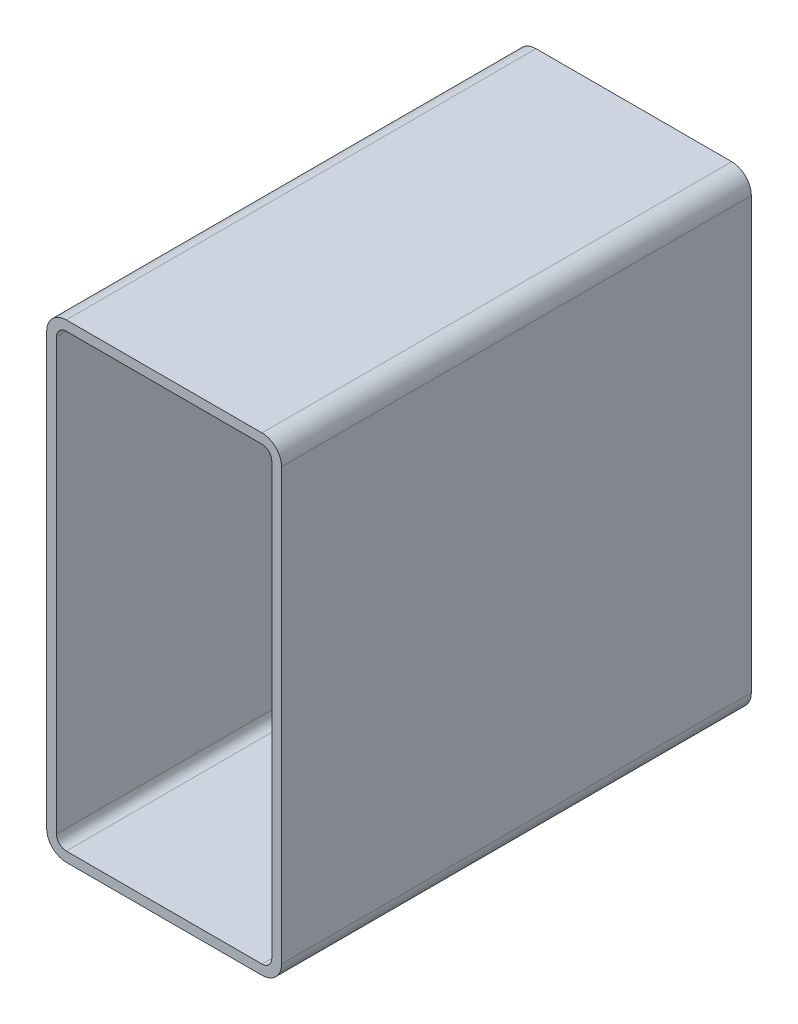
ISO-10303-21;
HEADER;
FILE_DESCRIPTION(('STEP AP214'),'2;1');
FILE_NAME('part.step','',(''),(''),'','','');
FILE_SCHEMA(('AUTOMOTIVE_DESIGN { 1 0 10303 214 1 1 1 1 }'));
ENDSEC;
DATA;
#1=APPLICATION_CONTEXT('core data for automotive mechanical design processes');
#2=APPLICATION_PROTOCOL_DEFINITION('international standard','automotive_design',2000,#1);
#3=PRODUCT_CONTEXT('',#1,'mechanical');
#4=PRODUCT('Part','Part','',(#3));
#5=PRODUCT_RELATED_PRODUCT_CATEGORY('part','',(#4));
#6=PRODUCT_DEFINITION_FORMATION('','',#4);
#7=PRODUCT_DEFINITION_CONTEXT('part definition',#1,'design');
#8=PRODUCT_DEFINITION('design','',#6,#7);
#9=PRODUCT_DEFINITION_SHAPE('','',#8);
#10=(LENGTH_UNIT() NAMED_UNIT(*) SI_UNIT(.MILLI.,.METRE.));
#11=(NAMED_UNIT(*) PLANE_ANGLE_UNIT() SI_UNIT($,.RADIAN.));
#12=(NAMED_UNIT(*) SI_UNIT($,.STERADIAN.) SOLID_ANGLE_UNIT());
#13=UNCERTAINTY_MEASURE_WITH_UNIT(LENGTH_MEASURE(1.E-05),#10,'distance_accuracy_value','');
#14=(GEOMETRIC_REPRESENTATION_CONTEXT(3) GLOBAL_UNCERTAINTY_ASSIGNED_CONTEXT((#13)) GLOBAL_UNIT_ASSIGNED_CONTEXT((#10,
#11,#12)) REPRESENTATION_CONTEXT('',''));
#15=CARTESIAN_POINT('',(0.,0.,0.));
#16=DIRECTION('',(0.,0.,1.));
#17=DIRECTION('',(1.,0.,0.));
#18=AXIS2_PLACEMENT_3D('',#15,#16,#17);
#19=CARTESIAN_POINT('',(12.7473013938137,293.974496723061,304.8));
#20=DIRECTION('',(0.,0.,1.));
#21=DIRECTION('',(1.,0.,0.));
#22=AXIS2_PLACEMENT_3D('',#19,#20,#21);
#23=PLANE('',#22);
#24=CARTESIAN_POINT('',(12.7473013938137,293.974496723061,304.8));
#25=DIRECTION('',(0.,0.,1.));
#26=DIRECTION('',(1.,0.,0.));
#27=AXIS2_PLACEMENT_3D('',#24,#25,#26);
#28=CIRCLE('',#27,12.7);
#29=CARTESIAN_POINT('',(12.7473013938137,306.674496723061,304.8));
#30=VERTEX_POINT('',#29);
#31=CARTESIAN_POINT('',(0.0473013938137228,293.974496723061,304.8));
#32=VERTEX_POINT('',#31);
#33=EDGE_CURVE('E211',#30,#32,#28,.T.);
#34=ORIENTED_EDGE('',*,*,#33,.T.);
#35=DIRECTION('',(0.,-1.,0.));
#36=VECTOR('',#35,1.);
#37=CARTESIAN_POINT('',(0.0473013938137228,14.5744967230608,304.8));
#38=LINE('',#37,#36);
#39=CARTESIAN_POINT('',(0.0473013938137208,14.5744967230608,304.8));
#40=VERTEX_POINT('',#39);
#41=EDGE_CURVE('E214',#32,#40,#38,.T.);
#42=ORIENTED_EDGE('',*,*,#41,.T.);
#43=CARTESIAN_POINT('',(12.7473013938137,14.5744967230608,304.8));
#44=DIRECTION('',(0.,0.,1.));
#45=DIRECTION('',(1.,0.,0.));
#46=AXIS2_PLACEMENT_3D('',#43,#44,#45);
#47=CIRCLE('',#46,12.7);
#48=CARTESIAN_POINT('',(12.7473013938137,1.87449672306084,304.8));
#49=VERTEX_POINT('',#48);
#50=EDGE_CURVE('E217',#40,#49,#47,.T.);
#51=ORIENTED_EDGE('',*,*,#50,.T.);
#52=DIRECTION('',(1.,0.,0.));
#53=VECTOR('',#52,1.);
#54=CARTESIAN_POINT('',(139.747301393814,1.87449672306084,304.8));
#55=LINE('',#54,#53);
#56=CARTESIAN_POINT('',(139.747301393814,1.87449672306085,304.8));
#57=VERTEX_POINT('',#56);
#58=EDGE_CURVE('E219',#49,#57,#55,.T.);
#59=ORIENTED_EDGE('',*,*,#58,.T.);
#60=CARTESIAN_POINT('',(139.747301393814,14.5744967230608,304.8));
#61=DIRECTION('',(0.,0.,1.));
#62=DIRECTION('',(1.,0.,0.));
#63=AXIS2_PLACEMENT_3D('',#60,#61,#62);
#64=CIRCLE('',#63,12.7);
#65=CARTESIAN_POINT('',(152.447301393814,14.5744967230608,304.8));
#66=VERTEX_POINT('',#65);
#67=EDGE_CURVE('E221',#57,#66,#64,.T.);
#68=ORIENTED_EDGE('',*,*,#67,.T.);
#69=DIRECTION('',(0.,1.,0.));
#70=VECTOR('',#69,1.);
#71=CARTESIAN_POINT('',(152.447301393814,293.974496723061,304.8));
#72=LINE('',#71,#70);
#73=CARTESIAN_POINT('',(152.447301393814,293.974496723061,304.8));
#74=VERTEX_POINT('',#73);
#75=EDGE_CURVE('E223',#66,#74,#72,.T.);
#76=ORIENTED_EDGE('',*,*,#75,.T.);
#77=CARTESIAN_POINT('',(139.747301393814,293.974496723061,304.8));
#78=DIRECTION('',(0.,0.,1.));
#79=DIRECTION('',(1.,0.,0.));
#80=AXIS2_PLACEMENT_3D('',#77,#78,#79);
#81=CIRCLE('',#80,12.7);
#82=CARTESIAN_POINT('',(139.747301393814,306.674496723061,304.8));
#83=VERTEX_POINT('',#82);
#84=EDGE_CURVE('E225',#74,#83,#81,.T.);
#85=ORIENTED_EDGE('',*,*,#84,.T.);
#86=DIRECTION('',(-1.,0.,0.));
#87=VECTOR('',#86,1.);
#88=CARTESIAN_POINT('',(12.7473013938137,306.674496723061,304.8));
#89=LINE('',#88,#87);
#90=EDGE_CURVE('E227',#83,#30,#89,.T.);
#91=ORIENTED_EDGE('',*,*,#90,.T.);
#92=EDGE_LOOP('',(#34,#42,#51,#59,#68,#76,#85,#91));
#93=FACE_BOUND('',#92,.T.);
#94=DIRECTION('',(0.,-1.,0.));
#95=VECTOR('',#94,1.);
#96=CARTESIAN_POINT('',(6.39730139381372,14.5744967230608,304.8));
#97=LINE('',#96,#95);
#98=CARTESIAN_POINT('',(6.39730139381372,293.974496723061,304.8));
#99=VERTEX_POINT('',#98);
#100=CARTESIAN_POINT('',(6.39730139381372,14.5744967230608,304.8));
#101=VERTEX_POINT('',#100);
#102=EDGE_CURVE('E154',#99,#101,#97,.T.);
#103=ORIENTED_EDGE('',*,*,#102,.F.);
#104=CARTESIAN_POINT('',(12.7473013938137,293.974496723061,304.8));
#105=DIRECTION('',(0.,0.,1.));
#106=DIRECTION('',(1.,0.,0.));
#107=AXIS2_PLACEMENT_3D('',#104,#105,#106);
#108=CIRCLE('',#107,6.35000000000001);
#109=CARTESIAN_POINT('',(12.7473013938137,300.324496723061,304.8));
#110=VERTEX_POINT('',#109);
#111=EDGE_CURVE('E146',#110,#99,#108,.T.);
#112=ORIENTED_EDGE('',*,*,#111,.F.);
#113=DIRECTION('',(-1.,0.,0.));
#114=VECTOR('',#113,1.);
#115=CARTESIAN_POINT('',(12.7473013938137,300.324496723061,304.8));
#116=LINE('',#115,#114);
#117=CARTESIAN_POINT('',(139.747301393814,300.324496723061,304.8));
#118=VERTEX_POINT('',#117);
#119=EDGE_CURVE('E179',#118,#110,#116,.T.);
#120=ORIENTED_EDGE('',*,*,#119,.F.);
#121=CARTESIAN_POINT('',(139.747301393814,293.974496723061,304.8));
#122=DIRECTION('',(0.,0.,1.));
#123=DIRECTION('',(1.,0.,0.));
#124=AXIS2_PLACEMENT_3D('',#121,#122,#123);
#125=CIRCLE('',#124,6.35000000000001);
#126=CARTESIAN_POINT('',(146.097301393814,293.974496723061,304.8));
#127=VERTEX_POINT('',#126);
#128=EDGE_CURVE('E177',#127,#118,#125,.T.);
#129=ORIENTED_EDGE('',*,*,#128,.F.);
#130=DIRECTION('',(0.,1.,0.));
#131=VECTOR('',#130,1.);
#132=CARTESIAN_POINT('',(146.097301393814,293.974496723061,304.8));
#133=LINE('',#132,#131);
#134=CARTESIAN_POINT('',(146.097301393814,14.5744967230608,304.8));
#135=VERTEX_POINT('',#134);
#136=EDGE_CURVE('E175',#135,#127,#133,.T.);
#137=ORIENTED_EDGE('',*,*,#136,.F.);
#138=CARTESIAN_POINT('',(139.747301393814,14.5744967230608,304.8));
#139=DIRECTION('',(0.,0.,1.));
#140=DIRECTION('',(1.,0.,0.));
#141=AXIS2_PLACEMENT_3D('',#138,#139,#140);
#142=CIRCLE('',#141,6.35);
#143=CARTESIAN_POINT('',(139.747301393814,8.22449672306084,304.8));
#144=VERTEX_POINT('',#143);
#145=EDGE_CURVE('E173',#144,#135,#142,.T.);
#146=ORIENTED_EDGE('',*,*,#145,.F.);
#147=DIRECTION('',(1.,0.,0.));
#148=VECTOR('',#147,1.);
#149=CARTESIAN_POINT('',(139.747301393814,8.22449672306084,304.8));
#150=LINE('',#149,#148);
#151=CARTESIAN_POINT('',(12.7473013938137,8.22449672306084,304.8));
#152=VERTEX_POINT('',#151);
#153=EDGE_CURVE('E169',#152,#144,#150,.T.);
#154=ORIENTED_EDGE('',*,*,#153,.F.);
#155=CARTESIAN_POINT('',(12.7473013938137,14.5744967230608,304.8));
#156=DIRECTION('',(0.,0.,1.));
#157=DIRECTION('',(1.,0.,0.));
#158=AXIS2_PLACEMENT_3D('',#155,#156,#157);
#159=CIRCLE('',#158,6.35);
#160=EDGE_CURVE('E167',#101,#152,#159,.T.);
#161=ORIENTED_EDGE('',*,*,#160,.F.);
#162=EDGE_LOOP('',(#103,#112,#120,#129,#137,#146,#154,#161));
#163=FACE_BOUND('',#162,.T.);
#164=ADVANCED_FACE('F33',(#93,#163),#23,.T.);
#165=CARTESIAN_POINT('',(12.7473013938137,293.974496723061,0.));
#166=DIRECTION('',(0.,0.,1.));
#167=DIRECTION('',(1.,0.,0.));
#168=AXIS2_PLACEMENT_3D('',#165,#166,#167);
#169=PLANE('',#168);
#170=CARTESIAN_POINT('',(12.7473013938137,293.974496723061,0.));
#171=DIRECTION('',(0.,0.,1.));
#172=DIRECTION('',(1.,0.,0.));
#173=AXIS2_PLACEMENT_3D('',#170,#171,#172);
#174=CIRCLE('',#173,12.7);
#175=CARTESIAN_POINT('',(12.7473013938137,306.674496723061,0.));
#176=VERTEX_POINT('',#175);
#177=CARTESIAN_POINT('',(0.0473013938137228,293.974496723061,0.));
#178=VERTEX_POINT('',#177);
#179=EDGE_CURVE('E162',#176,#178,#174,.T.);
#180=ORIENTED_EDGE('',*,*,#179,.F.);
#181=DIRECTION('',(-1.,0.,0.));
#182=VECTOR('',#181,1.);
#183=CARTESIAN_POINT('',(12.7473013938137,306.674496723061,0.));
#184=LINE('',#183,#182);
#185=CARTESIAN_POINT('',(139.747301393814,306.674496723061,0.));
#186=VERTEX_POINT('',#185);
#187=EDGE_CURVE('E215',#186,#176,#184,.T.);
#188=ORIENTED_EDGE('',*,*,#187,.F.);
#189=CARTESIAN_POINT('',(139.747301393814,293.974496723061,0.));
#190=DIRECTION('',(0.,0.,1.));
#191=DIRECTION('',(1.,0.,0.));
#192=AXIS2_PLACEMENT_3D('',#189,#190,#191);
#193=CIRCLE('',#192,12.7);
#194=CARTESIAN_POINT('',(152.447301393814,293.974496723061,0.));
#195=VERTEX_POINT('',#194);
#196=EDGE_CURVE('E242',#195,#186,#193,.T.);
#197=ORIENTED_EDGE('',*,*,#196,.F.);
#198=DIRECTION('',(0.,1.,0.));
#199=VECTOR('',#198,1.);
#200=CARTESIAN_POINT('',(152.447301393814,293.974496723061,0.));
#201=LINE('',#200,#199);
#202=CARTESIAN_POINT('',(152.447301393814,14.5744967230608,0.));
#203=VERTEX_POINT('',#202);
#204=EDGE_CURVE('E240',#203,#195,#201,.T.);
#205=ORIENTED_EDGE('',*,*,#204,.F.);
#206=CARTESIAN_POINT('',(139.747301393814,14.5744967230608,0.));
#207=DIRECTION('',(0.,0.,1.));
#208=DIRECTION('',(1.,0.,0.));
#209=AXIS2_PLACEMENT_3D('',#206,#207,#208);
#210=CIRCLE('',#209,12.7);
#211=CARTESIAN_POINT('',(139.747301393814,1.87449672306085,0.));
#212=VERTEX_POINT('',#211);
#213=EDGE_CURVE('E238',#212,#203,#210,.T.);
#214=ORIENTED_EDGE('',*,*,#213,.F.);
#215=DIRECTION('',(1.,0.,0.));
#216=VECTOR('',#215,1.);
#217=CARTESIAN_POINT('',(139.747301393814,1.87449672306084,0.));
#218=LINE('',#217,#216);
#219=CARTESIAN_POINT('',(12.7473013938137,1.87449672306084,0.));
#220=VERTEX_POINT('',#219);
#221=EDGE_CURVE('E236',#220,#212,#218,.T.);
#222=ORIENTED_EDGE('',*,*,#221,.F.);
#223=CARTESIAN_POINT('',(12.7473013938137,14.5744967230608,0.));
#224=DIRECTION('',(0.,0.,1.));
#225=DIRECTION('',(1.,0.,0.));
#226=AXIS2_PLACEMENT_3D('',#223,#224,#225);
#227=CIRCLE('',#226,12.7);
#228=CARTESIAN_POINT('',(0.0473013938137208,14.5744967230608,0.));
#229=VERTEX_POINT('',#228);
#230=EDGE_CURVE('E234',#229,#220,#227,.T.);
#231=ORIENTED_EDGE('',*,*,#230,.F.);
#232=DIRECTION('',(0.,-1.,0.));
#233=VECTOR('',#232,1.);
#234=CARTESIAN_POINT('',(0.0473013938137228,14.5744967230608,0.));
#235=LINE('',#234,#233);
#236=EDGE_CURVE('E232',#178,#229,#235,.T.);
#237=ORIENTED_EDGE('',*,*,#236,.F.);
#238=EDGE_LOOP('',(#180,#188,#197,#205,#214,#222,#231,#237));
#239=FACE_BOUND('',#238,.T.);
#240=CARTESIAN_POINT('',(12.7473013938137,293.974496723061,0.));
#241=DIRECTION('',(0.,0.,1.));
#242=DIRECTION('',(1.,0.,0.));
#243=AXIS2_PLACEMENT_3D('',#240,#241,#242);
#244=CIRCLE('',#243,6.35000000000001);
#245=CARTESIAN_POINT('',(12.7473013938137,300.324496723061,0.));
#246=VERTEX_POINT('',#245);
#247=CARTESIAN_POINT('',(6.39730139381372,293.974496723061,0.));
#248=VERTEX_POINT('',#247);
#249=EDGE_CURVE('E56',#246,#248,#244,.T.);
#250=ORIENTED_EDGE('',*,*,#249,.T.);
#251=DIRECTION('',(0.,-1.,0.));
#252=VECTOR('',#251,1.);
#253=CARTESIAN_POINT('',(6.39730139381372,14.5744967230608,0.));
#254=LINE('',#253,#252);
#255=CARTESIAN_POINT('',(6.39730139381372,14.5744967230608,0.));
#256=VERTEX_POINT('',#255);
#257=EDGE_CURVE('E161',#248,#256,#254,.T.);
#258=ORIENTED_EDGE('',*,*,#257,.T.);
#259=CARTESIAN_POINT('',(12.7473013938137,14.5744967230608,0.));
#260=DIRECTION('',(0.,0.,1.));
#261=DIRECTION('',(1.,0.,0.));
#262=AXIS2_PLACEMENT_3D('',#259,#260,#261);
#263=CIRCLE('',#262,6.35);
#264=CARTESIAN_POINT('',(12.7473013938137,8.22449672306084,0.));
#265=VERTEX_POINT('',#264);
#266=EDGE_CURVE('E183',#256,#265,#263,.T.);
#267=ORIENTED_EDGE('',*,*,#266,.T.);
#268=DIRECTION('',(1.,0.,0.));
#269=VECTOR('',#268,1.);
#270=CARTESIAN_POINT('',(139.747301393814,8.22449672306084,0.));
#271=LINE('',#270,#269);
#272=CARTESIAN_POINT('',(139.747301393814,8.22449672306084,0.));
#273=VERTEX_POINT('',#272);
#274=EDGE_CURVE('E186',#265,#273,#271,.T.);
#275=ORIENTED_EDGE('',*,*,#274,.T.);
#276=CARTESIAN_POINT('',(139.747301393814,14.5744967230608,0.));
#277=DIRECTION('',(0.,0.,1.));
#278=DIRECTION('',(1.,0.,0.));
#279=AXIS2_PLACEMENT_3D('',#276,#277,#278);
#280=CIRCLE('',#279,6.35);
#281=CARTESIAN_POINT('',(146.097301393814,14.5744967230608,0.));
#282=VERTEX_POINT('',#281);
#283=EDGE_CURVE('E189',#273,#282,#280,.T.);
#284=ORIENTED_EDGE('',*,*,#283,.T.);
#285=DIRECTION('',(0.,1.,0.));
#286=VECTOR('',#285,1.);
#287=CARTESIAN_POINT('',(146.097301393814,293.974496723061,0.));
#288=LINE('',#287,#286);
#289=CARTESIAN_POINT('',(146.097301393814,293.974496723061,0.));
#290=VERTEX_POINT('',#289);
#291=EDGE_CURVE('E192',#282,#290,#288,.T.);
#292=ORIENTED_EDGE('',*,*,#291,.T.);
#293=CARTESIAN_POINT('',(139.747301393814,293.974496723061,0.));
#294=DIRECTION('',(0.,0.,1.));
#295=DIRECTION('',(1.,0.,0.));
#296=AXIS2_PLACEMENT_3D('',#293,#294,#295);
#297=CIRCLE('',#296,6.35000000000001);
#298=CARTESIAN_POINT('',(139.747301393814,300.324496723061,0.));
#299=VERTEX_POINT('',#298);
#300=EDGE_CURVE('E195',#290,#299,#297,.T.);
#301=ORIENTED_EDGE('',*,*,#300,.T.);
#302=DIRECTION('',(-1.,0.,0.));
#303=VECTOR('',#302,1.);
#304=CARTESIAN_POINT('',(12.7473013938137,300.324496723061,0.));
#305=LINE('',#304,#303);
#306=EDGE_CURVE('E155',#299,#246,#305,.T.);
#307=ORIENTED_EDGE('',*,*,#306,.T.);
#308=EDGE_LOOP('',(#250,#258,#267,#275,#284,#292,#301,#307));
#309=FACE_BOUND('',#308,.T.);
#310=ADVANCED_FACE('F272',(#239,#309),#169,.F.);
#311=CARTESIAN_POINT('',(12.7473013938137,293.974496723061,304.8));
#312=DIRECTION('',(0.,0.,-1.));
#313=DIRECTION('',(-1.,0.,0.));
#314=AXIS2_PLACEMENT_3D('',#311,#312,#313);
#315=CYLINDRICAL_SURFACE('',#314,12.7);
#316=ORIENTED_EDGE('',*,*,#179,.T.);
#317=DIRECTION('',(0.,0.,-1.));
#318=VECTOR('',#317,1.);
#319=CARTESIAN_POINT('',(0.0473013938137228,293.974496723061,304.8));
#320=LINE('',#319,#318);
#321=EDGE_CURVE('E11',#32,#178,#320,.T.);
#322=ORIENTED_EDGE('',*,*,#321,.F.);
#323=ORIENTED_EDGE('',*,*,#33,.F.);
#324=DIRECTION('',(0.,0.,-1.));
#325=VECTOR('',#324,1.);
#326=CARTESIAN_POINT('',(12.7473013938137,306.674496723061,304.8));
#327=LINE('',#326,#325);
#328=EDGE_CURVE('E229',#30,#176,#327,.T.);
#329=ORIENTED_EDGE('',*,*,#328,.T.);
#330=EDGE_LOOP('',(#316,#322,#323,#329));
#331=FACE_BOUND('',#330,.T.);
#332=ADVANCED_FACE('F35',(#331),#315,.T.);
#333=CARTESIAN_POINT('',(0.0473013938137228,14.5744967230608,304.8));
#334=DIRECTION('',(1.,0.,0.));
#335=DIRECTION('',(0.,0.,-1.));
#336=AXIS2_PLACEMENT_3D('',#333,#334,#335);
#337=PLANE('',#336);
#338=ORIENTED_EDGE('',*,*,#236,.T.);
#339=DIRECTION('',(0.,0.,-1.));
#340=VECTOR('',#339,1.);
#341=CARTESIAN_POINT('',(0.0473013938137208,14.5744967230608,304.8));
#342=LINE('',#341,#340);
#343=EDGE_CURVE('E41',#40,#229,#342,.T.);
#344=ORIENTED_EDGE('',*,*,#343,.F.);
#345=ORIENTED_EDGE('',*,*,#41,.F.);
#346=ORIENTED_EDGE('',*,*,#321,.T.);
#347=EDGE_LOOP('',(#338,#344,#345,#346));
#348=FACE_BOUND('',#347,.T.);
#349=ADVANCED_FACE('F289',(#348),#337,.F.);
#350=CARTESIAN_POINT('',(12.7473013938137,14.5744967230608,304.8));
#351=DIRECTION('',(0.,0.,-1.));
#352=DIRECTION('',(-1.,0.,0.));
#353=AXIS2_PLACEMENT_3D('',#350,#351,#352);
#354=CYLINDRICAL_SURFACE('',#353,12.7);
#355=ORIENTED_EDGE('',*,*,#230,.T.);
#356=DIRECTION('',(0.,0.,-1.));
#357=VECTOR('',#356,1.);
#358=CARTESIAN_POINT('',(12.7473013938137,1.87449672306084,304.8));
#359=LINE('',#358,#357);
#360=EDGE_CURVE('E259',#49,#220,#359,.T.);
#361=ORIENTED_EDGE('',*,*,#360,.F.);
#362=ORIENTED_EDGE('',*,*,#50,.F.);
#363=ORIENTED_EDGE('',*,*,#343,.T.);
#364=EDGE_LOOP('',(#355,#361,#362,#363));
#365=FACE_BOUND('',#364,.T.);
#366=ADVANCED_FACE('F266',(#365),#354,.T.);
#367=CARTESIAN_POINT('',(139.747301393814,1.87449672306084,304.8));
#368=DIRECTION('',(0.,1.,0.));
#369=DIRECTION('',(0.,0.,1.));
#370=AXIS2_PLACEMENT_3D('',#367,#368,#369);
#371=PLANE('',#370);
#372=ORIENTED_EDGE('',*,*,#221,.T.);
#373=DIRECTION('',(0.,0.,-1.));
#374=VECTOR('',#373,1.);
#375=CARTESIAN_POINT('',(139.747301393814,1.87449672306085,304.8));
#376=LINE('',#375,#374);
#377=EDGE_CURVE('E256',#57,#212,#376,.T.);
#378=ORIENTED_EDGE('',*,*,#377,.F.);
#379=ORIENTED_EDGE('',*,*,#58,.F.);
#380=ORIENTED_EDGE('',*,*,#360,.T.);
#381=EDGE_LOOP('',(#372,#378,#379,#380));
#382=FACE_BOUND('',#381,.T.);
#383=ADVANCED_FACE('F278',(#382),#371,.F.);
#384=CARTESIAN_POINT('',(139.747301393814,14.5744967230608,304.8));
#385=DIRECTION('',(0.,0.,-1.));
#386=DIRECTION('',(-1.,0.,0.));
#387=AXIS2_PLACEMENT_3D('',#384,#385,#386);
#388=CYLINDRICAL_SURFACE('',#387,12.7);
#389=ORIENTED_EDGE('',*,*,#213,.T.);
#390=DIRECTION('',(0.,0.,-1.));
#391=VECTOR('',#390,1.);
#392=CARTESIAN_POINT('',(152.447301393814,14.5744967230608,304.8));
#393=LINE('',#392,#391);
#394=EDGE_CURVE('E253',#66,#203,#393,.T.);
#395=ORIENTED_EDGE('',*,*,#394,.F.);
#396=ORIENTED_EDGE('',*,*,#67,.F.);
#397=ORIENTED_EDGE('',*,*,#377,.T.);
#398=EDGE_LOOP('',(#389,#395,#396,#397));
#399=FACE_BOUND('',#398,.T.);
#400=ADVANCED_FACE('F282',(#399),#388,.T.);
#401=CARTESIAN_POINT('',(152.447301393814,293.974496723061,304.8));
#402=DIRECTION('',(-1.,0.,0.));
#403=DIRECTION('',(0.,0.,1.));
#404=AXIS2_PLACEMENT_3D('',#401,#402,#403);
#405=PLANE('',#404);
#406=ORIENTED_EDGE('',*,*,#204,.T.);
#407=DIRECTION('',(0.,0.,-1.));
#408=VECTOR('',#407,1.);
#409=CARTESIAN_POINT('',(152.447301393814,293.974496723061,304.8));
#410=LINE('',#409,#408);
#411=EDGE_CURVE('E250',#74,#195,#410,.T.);
#412=ORIENTED_EDGE('',*,*,#411,.F.);
#413=ORIENTED_EDGE('',*,*,#75,.F.);
#414=ORIENTED_EDGE('',*,*,#394,.T.);
#415=EDGE_LOOP('',(#406,#412,#413,#414));
#416=FACE_BOUND('',#415,.T.);
#417=ADVANCED_FACE('F302',(#416),#405,.F.);
#418=CARTESIAN_POINT('',(139.747301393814,293.974496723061,304.8));
#419=DIRECTION('',(0.,0.,-1.));
#420=DIRECTION('',(-1.,0.,0.));
#421=AXIS2_PLACEMENT_3D('',#418,#419,#420);
#422=CYLINDRICAL_SURFACE('',#421,12.7);
#423=ORIENTED_EDGE('',*,*,#196,.T.);
#424=DIRECTION('',(0.,0.,-1.));
#425=VECTOR('',#424,1.);
#426=CARTESIAN_POINT('',(139.747301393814,306.674496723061,304.8));
#427=LINE('',#426,#425);
#428=EDGE_CURVE('E247',#83,#186,#427,.T.);
#429=ORIENTED_EDGE('',*,*,#428,.F.);
#430=ORIENTED_EDGE('',*,*,#84,.F.);
#431=ORIENTED_EDGE('',*,*,#411,.T.);
#432=EDGE_LOOP('',(#423,#429,#430,#431));
#433=FACE_BOUND('',#432,.T.);
#434=ADVANCED_FACE('F300',(#433),#422,.T.);
#435=CARTESIAN_POINT('',(12.7473013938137,306.674496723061,304.8));
#436=DIRECTION('',(0.,-1.,0.));
#437=DIRECTION('',(0.,0.,-1.));
#438=AXIS2_PLACEMENT_3D('',#435,#436,#437);
#439=PLANE('',#438);
#440=ORIENTED_EDGE('',*,*,#187,.T.);
#441=ORIENTED_EDGE('',*,*,#328,.F.);
#442=ORIENTED_EDGE('',*,*,#90,.F.);
#443=ORIENTED_EDGE('',*,*,#428,.T.);
#444=EDGE_LOOP('',(#440,#441,#442,#443));
#445=FACE_BOUND('',#444,.T.);
#446=ADVANCED_FACE('F295',(#445),#439,.F.);
#447=CARTESIAN_POINT('',(12.7473013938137,293.974496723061,304.8));
#448=DIRECTION('',(0.,0.,-1.));
#449=DIRECTION('',(-1.,0.,0.));
#450=AXIS2_PLACEMENT_3D('',#447,#448,#449);
#451=CYLINDRICAL_SURFACE('',#450,6.35000000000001);
#452=ORIENTED_EDGE('',*,*,#249,.F.);
#453=DIRECTION('',(0.,0.,-1.));
#454=VECTOR('',#453,1.);
#455=CARTESIAN_POINT('',(12.7473013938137,300.324496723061,304.8));
#456=LINE('',#455,#454);
#457=EDGE_CURVE('E150',#110,#246,#456,.T.);
#458=ORIENTED_EDGE('',*,*,#457,.F.);
#459=ORIENTED_EDGE('',*,*,#111,.T.);
#460=DIRECTION('',(0.,0.,-1.));
#461=VECTOR('',#460,1.);
#462=CARTESIAN_POINT('',(6.39730139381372,293.974496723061,304.8));
#463=LINE('',#462,#461);
#464=EDGE_CURVE('E149',#99,#248,#463,.T.);
#465=ORIENTED_EDGE('',*,*,#464,.T.);
#466=EDGE_LOOP('',(#452,#458,#459,#465));
#467=FACE_BOUND('',#466,.T.);
#468=ADVANCED_FACE('F148',(#467),#451,.F.);
#469=CARTESIAN_POINT('',(6.39730139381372,14.5744967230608,304.8));
#470=DIRECTION('',(1.,0.,0.));
#471=DIRECTION('',(0.,0.,-1.));
#472=AXIS2_PLACEMENT_3D('',#469,#470,#471);
#473=PLANE('',#472);
#474=ORIENTED_EDGE('',*,*,#257,.F.);
#475=ORIENTED_EDGE('',*,*,#464,.F.);
#476=ORIENTED_EDGE('',*,*,#102,.T.);
#477=DIRECTION('',(0.,0.,-1.));
#478=VECTOR('',#477,1.);
#479=CARTESIAN_POINT('',(6.39730139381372,14.5744967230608,304.8));
#480=LINE('',#479,#478);
#481=EDGE_CURVE('E163',#101,#256,#480,.T.);
#482=ORIENTED_EDGE('',*,*,#481,.T.);
#483=EDGE_LOOP('',(#474,#475,#476,#482));
#484=FACE_BOUND('',#483,.T.);
#485=ADVANCED_FACE('F158',(#484),#473,.T.);
#486=CARTESIAN_POINT('',(12.7473013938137,14.5744967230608,304.8));
#487=DIRECTION('',(0.,0.,-1.));
#488=DIRECTION('',(-1.,0.,0.));
#489=AXIS2_PLACEMENT_3D('',#486,#487,#488);
#490=CYLINDRICAL_SURFACE('',#489,6.35);
#491=ORIENTED_EDGE('',*,*,#266,.F.);
#492=ORIENTED_EDGE('',*,*,#481,.F.);
#493=ORIENTED_EDGE('',*,*,#160,.T.);
#494=DIRECTION('',(0.,0.,-1.));
#495=VECTOR('',#494,1.);
#496=CARTESIAN_POINT('',(12.7473013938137,8.22449672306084,304.8));
#497=LINE('',#496,#495);
#498=EDGE_CURVE('E208',#152,#265,#497,.T.);
#499=ORIENTED_EDGE('',*,*,#498,.T.);
#500=EDGE_LOOP('',(#491,#492,#493,#499));
#501=FACE_BOUND('',#500,.T.);
#502=ADVANCED_FACE('F327',(#501),#490,.F.);
#503=CARTESIAN_POINT('',(139.747301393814,8.22449672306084,304.8));
#504=DIRECTION('',(0.,1.,0.));
#505=DIRECTION('',(0.,0.,1.));
#506=AXIS2_PLACEMENT_3D('',#503,#504,#505);
#507=PLANE('',#506);
#508=ORIENTED_EDGE('',*,*,#274,.F.);
#509=ORIENTED_EDGE('',*,*,#498,.F.);
#510=ORIENTED_EDGE('',*,*,#153,.T.);
#511=DIRECTION('',(0.,0.,-1.));
#512=VECTOR('',#511,1.);
#513=CARTESIAN_POINT('',(139.747301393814,8.22449672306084,304.8));
#514=LINE('',#513,#512);
#515=EDGE_CURVE('E206',#144,#273,#514,.T.);
#516=ORIENTED_EDGE('',*,*,#515,.T.);
#517=EDGE_LOOP('',(#508,#509,#510,#516));
#518=FACE_BOUND('',#517,.T.);
#519=ADVANCED_FACE('F331',(#518),#507,.T.);
#520=CARTESIAN_POINT('',(139.747301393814,14.5744967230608,304.8));
#521=DIRECTION('',(0.,0.,-1.));
#522=DIRECTION('',(-1.,0.,0.));
#523=AXIS2_PLACEMENT_3D('',#520,#521,#522);
#524=CYLINDRICAL_SURFACE('',#523,6.35);
#525=ORIENTED_EDGE('',*,*,#283,.F.);
#526=ORIENTED_EDGE('',*,*,#515,.F.);
#527=ORIENTED_EDGE('',*,*,#145,.T.);
#528=DIRECTION('',(0.,0.,-1.));
#529=VECTOR('',#528,1.);
#530=CARTESIAN_POINT('',(146.097301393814,14.5744967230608,304.8));
#531=LINE('',#530,#529);
#532=EDGE_CURVE('E204',#135,#282,#531,.T.);
#533=ORIENTED_EDGE('',*,*,#532,.T.);
#534=EDGE_LOOP('',(#525,#526,#527,#533));
#535=FACE_BOUND('',#534,.T.);
#536=ADVANCED_FACE('F337',(#535),#524,.F.);
#537=CARTESIAN_POINT('',(146.097301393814,293.974496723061,304.8));
#538=DIRECTION('',(-1.,0.,0.));
#539=DIRECTION('',(0.,0.,1.));
#540=AXIS2_PLACEMENT_3D('',#537,#538,#539);
#541=PLANE('',#540);
#542=ORIENTED_EDGE('',*,*,#291,.F.);
#543=ORIENTED_EDGE('',*,*,#532,.F.);
#544=ORIENTED_EDGE('',*,*,#136,.T.);
#545=DIRECTION('',(0.,0.,-1.));
#546=VECTOR('',#545,1.);
#547=CARTESIAN_POINT('',(146.097301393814,293.974496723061,304.8));
#548=LINE('',#547,#546);
#549=EDGE_CURVE('E202',#127,#290,#548,.T.);
#550=ORIENTED_EDGE('',*,*,#549,.T.);
#551=EDGE_LOOP('',(#542,#543,#544,#550));
#552=FACE_BOUND('',#551,.T.);
#553=ADVANCED_FACE('F341',(#552),#541,.T.);
#554=CARTESIAN_POINT('',(139.747301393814,293.974496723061,304.8));
#555=DIRECTION('',(0.,0.,-1.));
#556=DIRECTION('',(-1.,0.,0.));
#557=AXIS2_PLACEMENT_3D('',#554,#555,#556);
#558=CYLINDRICAL_SURFACE('',#557,6.35000000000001);
#559=ORIENTED_EDGE('',*,*,#300,.F.);
#560=ORIENTED_EDGE('',*,*,#549,.F.);
#561=ORIENTED_EDGE('',*,*,#128,.T.);
#562=DIRECTION('',(0.,0.,-1.));
#563=VECTOR('',#562,1.);
#564=CARTESIAN_POINT('',(139.747301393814,300.324496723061,304.8));
#565=LINE('',#564,#563);
#566=EDGE_CURVE('E48',#118,#299,#565,.T.);
#567=ORIENTED_EDGE('',*,*,#566,.T.);
#568=EDGE_LOOP('',(#559,#560,#561,#567));
#569=FACE_BOUND('',#568,.T.);
#570=ADVANCED_FACE('F345',(#569),#558,.F.);
#571=CARTESIAN_POINT('',(12.7473013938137,300.324496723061,304.8));
#572=DIRECTION('',(0.,-1.,0.));
#573=DIRECTION('',(0.,0.,-1.));
#574=AXIS2_PLACEMENT_3D('',#571,#572,#573);
#575=PLANE('',#574);
#576=ORIENTED_EDGE('',*,*,#306,.F.);
#577=ORIENTED_EDGE('',*,*,#566,.F.);
#578=ORIENTED_EDGE('',*,*,#119,.T.);
#579=ORIENTED_EDGE('',*,*,#457,.T.);
#580=EDGE_LOOP('',(#576,#577,#578,#579));
#581=FACE_BOUND('',#580,.T.);
#582=ADVANCED_FACE('F349',(#581),#575,.T.);
#583=CLOSED_SHELL('',(#164,#310,#332,#349,#366,#383,#400,#417,#434,#446,#468,#485,#502,#519,
#536,#553,#570,#582));
#584=MANIFOLD_SOLID_BREP('B2',#583);
#585=ADVANCED_BREP_SHAPE_REPRESENTATION('',(#18,#584),#14);
#586=SHAPE_DEFINITION_REPRESENTATION(#9,#585);
ENDSEC;
END-ISO-10303-21;
